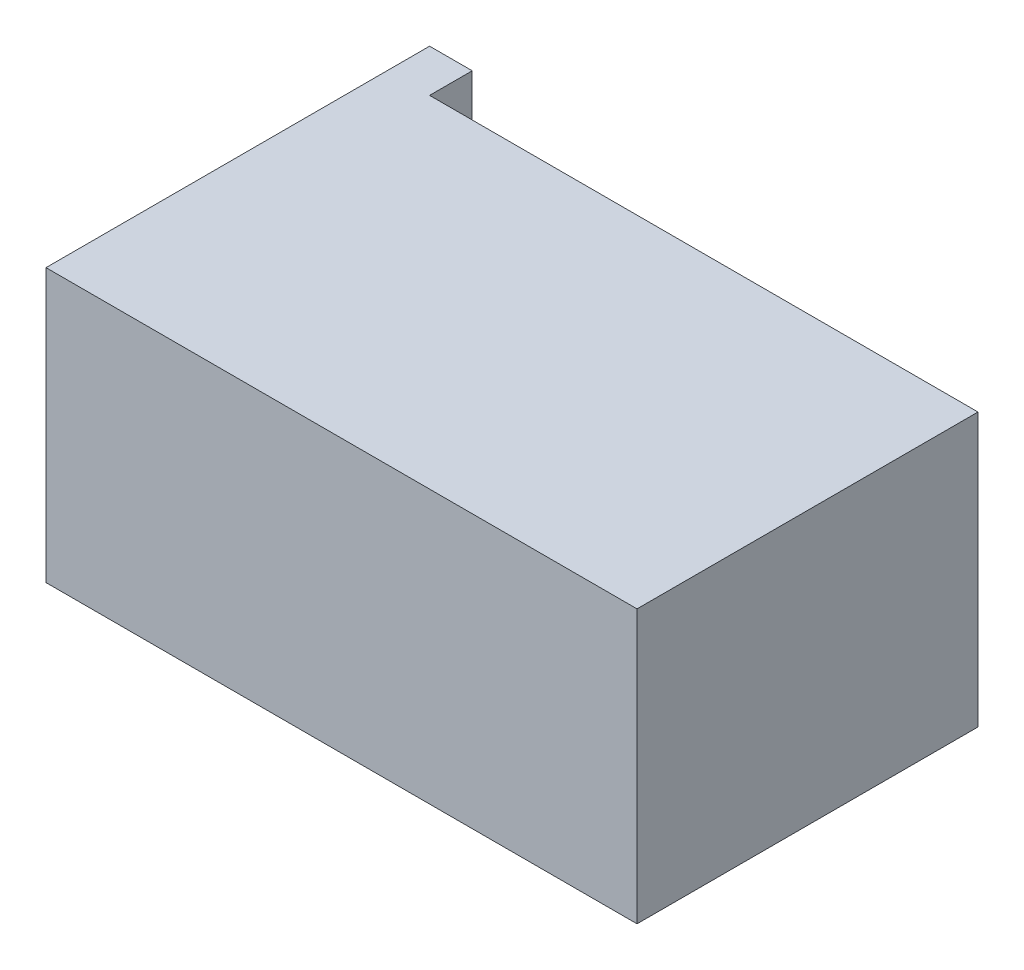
ISO-10303-21;
HEADER;
FILE_DESCRIPTION(('STEP AP214'),'2;1');
FILE_NAME('part.step','',(''),(''),'','','');
FILE_SCHEMA(('AUTOMOTIVE_DESIGN { 1 0 10303 214 1 1 1 1 }'));
ENDSEC;
DATA;
#1=APPLICATION_CONTEXT('core data for automotive mechanical design processes');
#2=APPLICATION_PROTOCOL_DEFINITION('international standard','automotive_design',2000,#1);
#3=PRODUCT_CONTEXT('',#1,'mechanical');
#4=PRODUCT('Part','Part','',(#3));
#5=PRODUCT_RELATED_PRODUCT_CATEGORY('part','',(#4));
#6=PRODUCT_DEFINITION_FORMATION('','',#4);
#7=PRODUCT_DEFINITION_CONTEXT('part definition',#1,'design');
#8=PRODUCT_DEFINITION('design','',#6,#7);
#9=PRODUCT_DEFINITION_SHAPE('','',#8);
#10=(LENGTH_UNIT() NAMED_UNIT(*) SI_UNIT(.MILLI.,.METRE.));
#11=(NAMED_UNIT(*) PLANE_ANGLE_UNIT() SI_UNIT($,.RADIAN.));
#12=(NAMED_UNIT(*) SI_UNIT($,.STERADIAN.) SOLID_ANGLE_UNIT());
#13=UNCERTAINTY_MEASURE_WITH_UNIT(LENGTH_MEASURE(1.E-05),#10,'distance_accuracy_value','');
#14=(GEOMETRIC_REPRESENTATION_CONTEXT(3) GLOBAL_UNCERTAINTY_ASSIGNED_CONTEXT((#13)) GLOBAL_UNIT_ASSIGNED_CONTEXT((#10,
#11,#12)) REPRESENTATION_CONTEXT('',''));
#15=CARTESIAN_POINT('',(0.,0.,0.));
#16=DIRECTION('',(0.,0.,1.));
#17=DIRECTION('',(1.,0.,0.));
#18=AXIS2_PLACEMENT_3D('',#15,#16,#17);
#19=CARTESIAN_POINT('',(0.,24.,-30.));
#20=DIRECTION('',(0.,0.,1.));
#21=DIRECTION('',(1.,0.,0.));
#22=AXIS2_PLACEMENT_3D('',#19,#20,#21);
#23=PLANE('',#22);
#24=DIRECTION('',(0.,-1.,0.));
#25=VECTOR('',#24,1.);
#26=CARTESIAN_POINT('',(3.75,24.,-30.));
#27=LINE('',#26,#25);
#28=CARTESIAN_POINT('',(3.75,24.,-30.));
#29=VERTEX_POINT('',#28);
#30=CARTESIAN_POINT('',(3.75,0.,-30.));
#31=VERTEX_POINT('',#30);
#32=EDGE_CURVE('E55',#29,#31,#27,.T.);
#33=ORIENTED_EDGE('',*,*,#32,.F.);
#34=DIRECTION('',(-1.,0.,0.));
#35=VECTOR('',#34,1.);
#36=CARTESIAN_POINT('',(0.,24.,-30.));
#37=LINE('',#36,#35);
#38=CARTESIAN_POINT('',(52.,24.,-30.));
#39=VERTEX_POINT('',#38);
#40=EDGE_CURVE('E146',#39,#29,#37,.T.);
#41=ORIENTED_EDGE('',*,*,#40,.F.);
#42=DIRECTION('',(0.,-1.,0.));
#43=VECTOR('',#42,1.);
#44=CARTESIAN_POINT('',(52.,24.,-30.));
#45=LINE('',#44,#43);
#46=CARTESIAN_POINT('',(52.,0.,-30.));
#47=VERTEX_POINT('',#46);
#48=EDGE_CURVE('E148',#39,#47,#45,.T.);
#49=ORIENTED_EDGE('',*,*,#48,.T.);
#50=DIRECTION('',(-1.,0.,0.));
#51=VECTOR('',#50,1.);
#52=CARTESIAN_POINT('',(0.,0.,-30.));
#53=LINE('',#52,#51);
#54=EDGE_CURVE('E141',#47,#31,#53,.T.);
#55=ORIENTED_EDGE('',*,*,#54,.T.);
#56=EDGE_LOOP('',(#33,#41,#49,#55));
#57=FACE_BOUND('',#56,.T.);
#58=ADVANCED_FACE('F39',(#57),#23,.F.);
#59=CARTESIAN_POINT('',(0.,24.,0.));
#60=DIRECTION('',(1.,0.,0.));
#61=DIRECTION('',(0.,0.,-1.));
#62=AXIS2_PLACEMENT_3D('',#59,#60,#61);
#63=PLANE('',#62);
#64=DIRECTION('',(0.,0.,1.));
#65=VECTOR('',#64,1.);
#66=CARTESIAN_POINT('',(0.,0.,0.));
#67=LINE('',#66,#65);
#68=CARTESIAN_POINT('',(0.,0.,-33.75));
#69=VERTEX_POINT('',#68);
#70=CARTESIAN_POINT('',(0.,0.,0.));
#71=VERTEX_POINT('',#70);
#72=EDGE_CURVE('E110',#69,#71,#67,.T.);
#73=ORIENTED_EDGE('',*,*,#72,.T.);
#74=DIRECTION('',(0.,-1.,0.));
#75=VECTOR('',#74,1.);
#76=CARTESIAN_POINT('',(0.,24.,0.));
#77=LINE('',#76,#75);
#78=CARTESIAN_POINT('',(0.,24.,0.));
#79=VERTEX_POINT('',#78);
#80=EDGE_CURVE('E11',#79,#71,#77,.T.);
#81=ORIENTED_EDGE('',*,*,#80,.F.);
#82=DIRECTION('',(0.,0.,1.));
#83=VECTOR('',#82,1.);
#84=CARTESIAN_POINT('',(0.,24.,0.));
#85=LINE('',#84,#83);
#86=CARTESIAN_POINT('',(0.,24.,-33.75));
#87=VERTEX_POINT('',#86);
#88=EDGE_CURVE('E138',#87,#79,#85,.T.);
#89=ORIENTED_EDGE('',*,*,#88,.F.);
#90=DIRECTION('',(0.,1.,0.));
#91=VECTOR('',#90,1.);
#92=CARTESIAN_POINT('',(0.,24.,-33.75));
#93=LINE('',#92,#91);
#94=EDGE_CURVE('E115',#69,#87,#93,.T.);
#95=ORIENTED_EDGE('',*,*,#94,.F.);
#96=EDGE_LOOP('',(#73,#81,#89,#95));
#97=FACE_BOUND('',#96,.T.);
#98=ADVANCED_FACE('F41',(#97),#63,.F.);
#99=CARTESIAN_POINT('',(0.,24.,0.));
#100=DIRECTION('',(0.,0.,-1.));
#101=DIRECTION('',(-1.,0.,0.));
#102=AXIS2_PLACEMENT_3D('',#99,#100,#101);
#103=PLANE('',#102);
#104=DIRECTION('',(1.,0.,0.));
#105=VECTOR('',#104,1.);
#106=CARTESIAN_POINT('',(0.,0.,0.));
#107=LINE('',#106,#105);
#108=CARTESIAN_POINT('',(52.,0.,0.));
#109=VERTEX_POINT('',#108);
#110=EDGE_CURVE('E133',#71,#109,#107,.T.);
#111=ORIENTED_EDGE('',*,*,#110,.T.);
#112=DIRECTION('',(0.,-1.,0.));
#113=VECTOR('',#112,1.);
#114=CARTESIAN_POINT('',(52.,24.,0.));
#115=LINE('',#114,#113);
#116=CARTESIAN_POINT('',(52.,24.,0.));
#117=VERTEX_POINT('',#116);
#118=EDGE_CURVE('E48',#117,#109,#115,.T.);
#119=ORIENTED_EDGE('',*,*,#118,.F.);
#120=DIRECTION('',(1.,0.,0.));
#121=VECTOR('',#120,1.);
#122=CARTESIAN_POINT('',(0.,24.,0.));
#123=LINE('',#122,#121);
#124=EDGE_CURVE('E85',#79,#117,#123,.T.);
#125=ORIENTED_EDGE('',*,*,#124,.F.);
#126=ORIENTED_EDGE('',*,*,#80,.T.);
#127=EDGE_LOOP('',(#111,#119,#125,#126));
#128=FACE_BOUND('',#127,.T.);
#129=ADVANCED_FACE('F167',(#128),#103,.F.);
#130=CARTESIAN_POINT('',(52.,24.,0.));
#131=DIRECTION('',(-1.,0.,0.));
#132=DIRECTION('',(0.,0.,1.));
#133=AXIS2_PLACEMENT_3D('',#130,#131,#132);
#134=PLANE('',#133);
#135=DIRECTION('',(0.,0.,-1.));
#136=VECTOR('',#135,1.);
#137=CARTESIAN_POINT('',(52.,0.,0.));
#138=LINE('',#137,#136);
#139=EDGE_CURVE('E80',#109,#47,#138,.T.);
#140=ORIENTED_EDGE('',*,*,#139,.T.);
#141=ORIENTED_EDGE('',*,*,#48,.F.);
#142=DIRECTION('',(0.,0.,-1.));
#143=VECTOR('',#142,1.);
#144=CARTESIAN_POINT('',(52.,24.,0.));
#145=LINE('',#144,#143);
#146=EDGE_CURVE('E63',#117,#39,#145,.T.);
#147=ORIENTED_EDGE('',*,*,#146,.F.);
#148=ORIENTED_EDGE('',*,*,#118,.T.);
#149=EDGE_LOOP('',(#140,#141,#147,#148));
#150=FACE_BOUND('',#149,.T.);
#151=ADVANCED_FACE('F158',(#150),#134,.F.);
#152=CARTESIAN_POINT('',(0.,24.,0.));
#153=DIRECTION('',(0.,-1.,0.));
#154=DIRECTION('',(0.,0.,-1.));
#155=AXIS2_PLACEMENT_3D('',#152,#153,#154);
#156=PLANE('',#155);
#157=ORIENTED_EDGE('',*,*,#88,.T.);
#158=ORIENTED_EDGE('',*,*,#124,.T.);
#159=ORIENTED_EDGE('',*,*,#146,.T.);
#160=ORIENTED_EDGE('',*,*,#40,.T.);
#161=DIRECTION('',(0.,0.,1.));
#162=VECTOR('',#161,1.);
#163=CARTESIAN_POINT('',(3.75,24.,-33.75));
#164=LINE('',#163,#162);
#165=CARTESIAN_POINT('',(3.75,24.,-33.75));
#166=VERTEX_POINT('',#165);
#167=EDGE_CURVE('E129',#166,#29,#164,.T.);
#168=ORIENTED_EDGE('',*,*,#167,.F.);
#169=DIRECTION('',(1.,0.,0.));
#170=VECTOR('',#169,1.);
#171=CARTESIAN_POINT('',(3.75,24.,-33.75));
#172=LINE('',#171,#170);
#173=EDGE_CURVE('E121',#87,#166,#172,.T.);
#174=ORIENTED_EDGE('',*,*,#173,.F.);
#175=EDGE_LOOP('',(#157,#158,#159,#160,#168,#174));
#176=FACE_BOUND('',#175,.T.);
#177=ADVANCED_FACE('F159',(#176),#156,.F.);
#178=CARTESIAN_POINT('',(0.,0.,0.));
#179=DIRECTION('',(0.,-1.,0.));
#180=DIRECTION('',(0.,0.,-1.));
#181=AXIS2_PLACEMENT_3D('',#178,#179,#180);
#182=PLANE('',#181);
#183=ORIENTED_EDGE('',*,*,#72,.F.);
#184=DIRECTION('',(-1.,0.,0.));
#185=VECTOR('',#184,1.);
#186=CARTESIAN_POINT('',(3.75,0.,-33.75));
#187=LINE('',#186,#185);
#188=CARTESIAN_POINT('',(3.75,0.,-33.75));
#189=VERTEX_POINT('',#188);
#190=EDGE_CURVE('E103',#189,#69,#187,.T.);
#191=ORIENTED_EDGE('',*,*,#190,.F.);
#192=DIRECTION('',(0.,0.,1.));
#193=VECTOR('',#192,1.);
#194=CARTESIAN_POINT('',(3.75,0.,-33.75));
#195=LINE('',#194,#193);
#196=EDGE_CURVE('E108',#189,#31,#195,.T.);
#197=ORIENTED_EDGE('',*,*,#196,.T.);
#198=ORIENTED_EDGE('',*,*,#54,.F.);
#199=ORIENTED_EDGE('',*,*,#139,.F.);
#200=ORIENTED_EDGE('',*,*,#110,.F.);
#201=EDGE_LOOP('',(#183,#191,#197,#198,#199,#200));
#202=FACE_BOUND('',#201,.T.);
#203=ADVANCED_FACE('F105',(#202),#182,.T.);
#204=CARTESIAN_POINT('',(3.75,24.,-33.75));
#205=DIRECTION('',(-1.,0.,0.));
#206=DIRECTION('',(0.,-1.,0.));
#207=AXIS2_PLACEMENT_3D('',#204,#205,#206);
#208=PLANE('',#207);
#209=ORIENTED_EDGE('',*,*,#32,.T.);
#210=ORIENTED_EDGE('',*,*,#196,.F.);
#211=DIRECTION('',(0.,-1.,0.));
#212=VECTOR('',#211,1.);
#213=CARTESIAN_POINT('',(3.75,24.,-33.75));
#214=LINE('',#213,#212);
#215=EDGE_CURVE('E116',#166,#189,#214,.T.);
#216=ORIENTED_EDGE('',*,*,#215,.F.);
#217=ORIENTED_EDGE('',*,*,#167,.T.);
#218=EDGE_LOOP('',(#209,#210,#216,#217));
#219=FACE_BOUND('',#218,.T.);
#220=ADVANCED_FACE('F127',(#219),#208,.F.);
#221=CARTESIAN_POINT('',(0.,0.,-33.75));
#222=DIRECTION('',(0.,0.,-1.));
#223=DIRECTION('',(-1.,0.,0.));
#224=AXIS2_PLACEMENT_3D('',#221,#222,#223);
#225=PLANE('',#224);
#226=ORIENTED_EDGE('',*,*,#215,.T.);
#227=ORIENTED_EDGE('',*,*,#190,.T.);
#228=ORIENTED_EDGE('',*,*,#94,.T.);
#229=ORIENTED_EDGE('',*,*,#173,.T.);
#230=EDGE_LOOP('',(#226,#227,#228,#229));
#231=FACE_BOUND('',#230,.T.);
#232=ADVANCED_FACE('F119',(#231),#225,.T.);
#233=CLOSED_SHELL('',(#58,#98,#129,#151,#177,#203,#220,#232));
#234=MANIFOLD_SOLID_BREP('B2',#233);
#235=ADVANCED_BREP_SHAPE_REPRESENTATION('',(#18,#234),#14);
#236=SHAPE_DEFINITION_REPRESENTATION(#9,#235);
ENDSEC;
END-ISO-10303-21;
